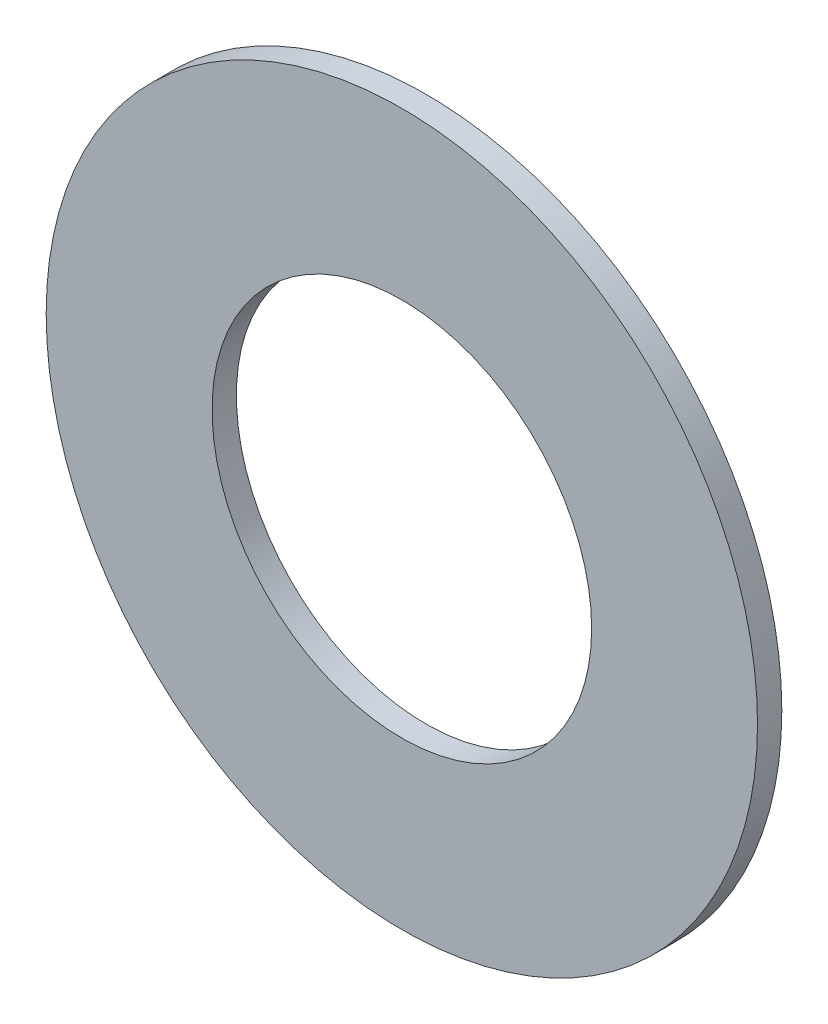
from build123d import *

# Parameters (mm, degrees)
SKETCH1_R      = 11.8999
SKETCH1_R_2    = 6.35
EXTRUDE1_DEPTH = 0.8128


with BuildPart() as part:
    # Sketch1 → Extrude1 (new body)
    with BuildSketch(Plane.XY):
        Circle(SKETCH1_R)
        Circle(SKETCH1_R_2, mode=Mode.SUBTRACT)
    extrude(amount=EXTRUDE1_DEPTH)


solid = part.part
